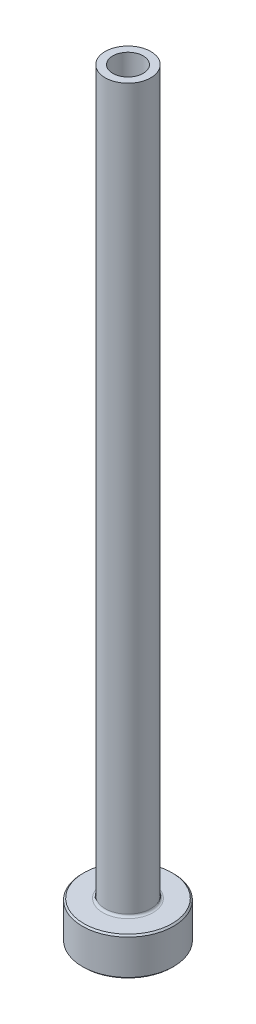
from build123d import *

# Parameters (mm, degrees)
FILLET1_R     = 0.3
CHAMFER1_SIZE = 0.2
CHAMFER3_SIZE = 0.5


with BuildPart() as part:
    # Sketch1 → Revolve1 (revolve)
    with BuildSketch(Plane.XY, mode=Mode.PRIVATE) as revolve1_sk:
        Polygon((-2, 100), (-3, 100), (-3, 5), (-6, 5), (-6, 0), (-2.25, 0), (-2.25, 43), (-2, 55), align=None)
    revolve(revolve1_sk.sketch.rotate(Axis((0, 92.187680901, 0), (0, -1, 0)), 270), axis=Axis((0, 92.187680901, 0), (0, -1, 0)))

    # Fillet1
    fillet1_edges = [part.edges().sort_by_distance(p)[0] for p in [
        (0, 5, -3),
    ]]
    fillet(fillet1_edges, radius=FILLET1_R)

    # Chamfer1
    chamfer1_edges = [part.edges().sort_by_distance(p)[0] for p in [
        (0, 0, -6),
        (0, 5, -6),
    ]]
    chamfer(chamfer1_edges, length=CHAMFER1_SIZE)

    # Chamfer3
    chamfer3_edges = [part.edges().sort_by_distance(p)[0] for p in [
        (0, 0, -2.25),
    ]]
    chamfer(chamfer3_edges, length=CHAMFER3_SIZE)


solid = part.part
